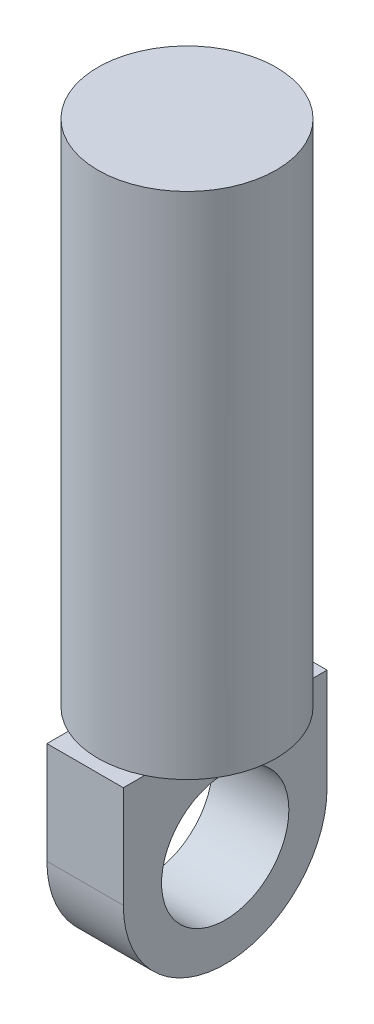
ISO-10303-21;
HEADER;
FILE_DESCRIPTION(('STEP AP214'),'2;1');
FILE_NAME('part.step','',(''),(''),'','','');
FILE_SCHEMA(('AUTOMOTIVE_DESIGN { 1 0 10303 214 1 1 1 1 }'));
ENDSEC;
DATA;
#1=APPLICATION_CONTEXT('core data for automotive mechanical design processes');
#2=APPLICATION_PROTOCOL_DEFINITION('international standard','automotive_design',2000,#1);
#3=PRODUCT_CONTEXT('',#1,'mechanical');
#4=PRODUCT('Part','Part','',(#3));
#5=PRODUCT_RELATED_PRODUCT_CATEGORY('part','',(#4));
#6=PRODUCT_DEFINITION_FORMATION('','',#4);
#7=PRODUCT_DEFINITION_CONTEXT('part definition',#1,'design');
#8=PRODUCT_DEFINITION('design','',#6,#7);
#9=PRODUCT_DEFINITION_SHAPE('','',#8);
#10=(LENGTH_UNIT() NAMED_UNIT(*) SI_UNIT(.MILLI.,.METRE.));
#11=(NAMED_UNIT(*) PLANE_ANGLE_UNIT() SI_UNIT($,.RADIAN.));
#12=(NAMED_UNIT(*) SI_UNIT($,.STERADIAN.) SOLID_ANGLE_UNIT());
#13=UNCERTAINTY_MEASURE_WITH_UNIT(LENGTH_MEASURE(1.E-05),#10,'distance_accuracy_value','');
#14=(GEOMETRIC_REPRESENTATION_CONTEXT(3) GLOBAL_UNCERTAINTY_ASSIGNED_CONTEXT((#13)) GLOBAL_UNIT_ASSIGNED_CONTEXT((#10,
#11,#12)) REPRESENTATION_CONTEXT('',''));
#15=CARTESIAN_POINT('',(0.,0.,0.));
#16=DIRECTION('',(0.,0.,1.));
#17=DIRECTION('',(1.,0.,0.));
#18=AXIS2_PLACEMENT_3D('',#15,#16,#17);
#19=CARTESIAN_POINT('',(37.5,100.,100.));
#20=DIRECTION('',(0.,-1.,0.));
#21=DIRECTION('',(0.,0.,-1.));
#22=AXIS2_PLACEMENT_3D('',#19,#20,#21);
#23=PLANE('',#22);
#24=CARTESIAN_POINT('',(0.,100.,0.));
#25=DIRECTION('',(0.,1.,0.));
#26=DIRECTION('',(0.,0.,1.));
#27=AXIS2_PLACEMENT_3D('',#24,#25,#26);
#28=CIRCLE('',#27,87.5);
#29=CARTESIAN_POINT('',(37.5,100.,-79.0569415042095));
#30=VERTEX_POINT('',#29);
#31=CARTESIAN_POINT('',(-37.5,100.,-79.0569415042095));
#32=VERTEX_POINT('',#31);
#33=EDGE_CURVE('E11',#30,#32,#28,.T.);
#34=ORIENTED_EDGE('',*,*,#33,.F.);
#35=DIRECTION('',(0.,0.,1.));
#36=VECTOR('',#35,1.);
#37=CARTESIAN_POINT('',(37.5,100.,100.));
#38=LINE('',#37,#36);
#39=CARTESIAN_POINT('',(37.5,100.,-100.));
#40=VERTEX_POINT('',#39);
#41=EDGE_CURVE('E98',#40,#30,#38,.T.);
#42=ORIENTED_EDGE('',*,*,#41,.F.);
#43=DIRECTION('',(-1.,0.,0.));
#44=VECTOR('',#43,1.);
#45=CARTESIAN_POINT('',(37.5,100.,-100.));
#46=LINE('',#45,#44);
#47=CARTESIAN_POINT('',(-37.5,100.,-100.));
#48=VERTEX_POINT('',#47);
#49=EDGE_CURVE('E143',#40,#48,#46,.T.);
#50=ORIENTED_EDGE('',*,*,#49,.T.);
#51=DIRECTION('',(0.,0.,1.));
#52=VECTOR('',#51,1.);
#53=CARTESIAN_POINT('',(-37.5,100.,100.));
#54=LINE('',#53,#52);
#55=EDGE_CURVE('E137',#48,#32,#54,.T.);
#56=ORIENTED_EDGE('',*,*,#55,.T.);
#57=EDGE_LOOP('',(#34,#42,#50,#56));
#58=FACE_BOUND('',#57,.T.);
#59=ADVANCED_FACE('F37',(#58),#23,.F.);
#60=CARTESIAN_POINT('',(37.5,0.,0.));
#61=DIRECTION('',(1.,0.,0.));
#62=DIRECTION('',(0.,0.,-1.));
#63=AXIS2_PLACEMENT_3D('',#60,#61,#62);
#64=PLANE('',#63);
#65=CARTESIAN_POINT('',(37.5,0.,0.));
#66=DIRECTION('',(1.,0.,0.));
#67=DIRECTION('',(0.,0.,-1.));
#68=AXIS2_PLACEMENT_3D('',#65,#66,#67);
#69=CIRCLE('',#68,100.);
#70=CARTESIAN_POINT('',(37.5,0.,100.));
#71=VERTEX_POINT('',#70);
#72=CARTESIAN_POINT('',(37.5,0.,-100.));
#73=VERTEX_POINT('',#72);
#74=EDGE_CURVE('E125',#71,#73,#69,.T.);
#75=ORIENTED_EDGE('',*,*,#74,.T.);
#76=DIRECTION('',(0.,1.,0.));
#77=VECTOR('',#76,1.);
#78=CARTESIAN_POINT('',(37.5,100.,-100.));
#79=LINE('',#78,#77);
#80=EDGE_CURVE('E107',#73,#40,#79,.T.);
#81=ORIENTED_EDGE('',*,*,#80,.T.);
#82=ORIENTED_EDGE('',*,*,#41,.T.);
#83=CARTESIAN_POINT('',(37.5,100.,79.0569415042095));
#84=VERTEX_POINT('',#83);
#85=EDGE_CURVE('E92',#30,#84,#38,.T.);
#86=ORIENTED_EDGE('',*,*,#85,.T.);
#87=CARTESIAN_POINT('',(37.5,100.,100.));
#88=VERTEX_POINT('',#87);
#89=EDGE_CURVE('E96',#84,#88,#38,.T.);
#90=ORIENTED_EDGE('',*,*,#89,.T.);
#91=DIRECTION('',(0.,-1.,0.));
#92=VECTOR('',#91,1.);
#93=CARTESIAN_POINT('',(37.5,0.,100.));
#94=LINE('',#93,#92);
#95=EDGE_CURVE('E129',#88,#71,#94,.T.);
#96=ORIENTED_EDGE('',*,*,#95,.T.);
#97=EDGE_LOOP('',(#75,#81,#82,#86,#90,#96));
#98=FACE_BOUND('',#97,.T.);
#99=CARTESIAN_POINT('',(37.5,0.,0.));
#100=DIRECTION('',(1.,0.,0.));
#101=DIRECTION('',(0.,0.,-1.));
#102=AXIS2_PLACEMENT_3D('',#99,#100,#101);
#103=CIRCLE('',#102,62.5);
#104=CARTESIAN_POINT('',(37.5,0.,-62.5));
#105=VERTEX_POINT('',#104);
#106=EDGE_CURVE('E119',#105,#105,#103,.T.);
#107=ORIENTED_EDGE('',*,*,#106,.F.);
#108=EDGE_LOOP('',(#107));
#109=FACE_BOUND('',#108,.T.);
#110=ADVANCED_FACE('F94',(#98,#109),#64,.T.);
#111=CARTESIAN_POINT('',(-37.5,0.,0.));
#112=DIRECTION('',(1.,0.,0.));
#113=DIRECTION('',(0.,0.,-1.));
#114=AXIS2_PLACEMENT_3D('',#111,#112,#113);
#115=PLANE('',#114);
#116=CARTESIAN_POINT('',(-37.5,0.,0.));
#117=DIRECTION('',(1.,0.,0.));
#118=DIRECTION('',(0.,0.,-1.));
#119=AXIS2_PLACEMENT_3D('',#116,#117,#118);
#120=CIRCLE('',#119,100.);
#121=CARTESIAN_POINT('',(-37.5,0.,100.));
#122=VERTEX_POINT('',#121);
#123=CARTESIAN_POINT('',(-37.5,0.,-100.));
#124=VERTEX_POINT('',#123);
#125=EDGE_CURVE('E122',#122,#124,#120,.T.);
#126=ORIENTED_EDGE('',*,*,#125,.F.);
#127=DIRECTION('',(0.,-1.,0.));
#128=VECTOR('',#127,1.);
#129=CARTESIAN_POINT('',(-37.5,0.,100.));
#130=LINE('',#129,#128);
#131=CARTESIAN_POINT('',(-37.5,100.,100.));
#132=VERTEX_POINT('',#131);
#133=EDGE_CURVE('E127',#132,#122,#130,.T.);
#134=ORIENTED_EDGE('',*,*,#133,.F.);
#135=CARTESIAN_POINT('',(-37.5,100.,79.0569415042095));
#136=VERTEX_POINT('',#135);
#137=EDGE_CURVE('E136',#136,#132,#54,.T.);
#138=ORIENTED_EDGE('',*,*,#137,.F.);
#139=EDGE_CURVE('E139',#32,#136,#54,.T.);
#140=ORIENTED_EDGE('',*,*,#139,.F.);
#141=ORIENTED_EDGE('',*,*,#55,.F.);
#142=DIRECTION('',(0.,1.,0.));
#143=VECTOR('',#142,1.);
#144=CARTESIAN_POINT('',(-37.5,100.,-100.));
#145=LINE('',#144,#143);
#146=EDGE_CURVE('E134',#124,#48,#145,.T.);
#147=ORIENTED_EDGE('',*,*,#146,.F.);
#148=EDGE_LOOP('',(#126,#134,#138,#140,#141,#147));
#149=FACE_BOUND('',#148,.T.);
#150=CARTESIAN_POINT('',(-37.5,0.,0.));
#151=DIRECTION('',(1.,0.,0.));
#152=DIRECTION('',(0.,0.,-1.));
#153=AXIS2_PLACEMENT_3D('',#150,#151,#152);
#154=CIRCLE('',#153,62.5);
#155=CARTESIAN_POINT('',(-37.5,0.,-62.5));
#156=VERTEX_POINT('',#155);
#157=EDGE_CURVE('E116',#156,#156,#154,.T.);
#158=ORIENTED_EDGE('',*,*,#157,.T.);
#159=EDGE_LOOP('',(#158));
#160=FACE_BOUND('',#159,.T.);
#161=ADVANCED_FACE('F157',(#149,#160),#115,.F.);
#162=CARTESIAN_POINT('',(37.5,0.,0.));
#163=DIRECTION('',(-1.,0.,0.));
#164=DIRECTION('',(0.,0.,1.));
#165=AXIS2_PLACEMENT_3D('',#162,#163,#164);
#166=CYLINDRICAL_SURFACE('',#165,100.);
#167=ORIENTED_EDGE('',*,*,#125,.T.);
#168=DIRECTION('',(-1.,0.,0.));
#169=VECTOR('',#168,1.);
#170=CARTESIAN_POINT('',(37.5,0.,-100.));
#171=LINE('',#170,#169);
#172=EDGE_CURVE('E41',#73,#124,#171,.T.);
#173=ORIENTED_EDGE('',*,*,#172,.F.);
#174=ORIENTED_EDGE('',*,*,#74,.F.);
#175=DIRECTION('',(-1.,0.,0.));
#176=VECTOR('',#175,1.);
#177=CARTESIAN_POINT('',(37.5,0.,100.));
#178=LINE('',#177,#176);
#179=EDGE_CURVE('E131',#71,#122,#178,.T.);
#180=ORIENTED_EDGE('',*,*,#179,.T.);
#181=EDGE_LOOP('',(#167,#173,#174,#180));
#182=FACE_BOUND('',#181,.T.);
#183=ADVANCED_FACE('F39',(#182),#166,.T.);
#184=CARTESIAN_POINT('',(37.5,100.,-100.));
#185=DIRECTION('',(0.,0.,1.));
#186=DIRECTION('',(1.,0.,0.));
#187=AXIS2_PLACEMENT_3D('',#184,#185,#186);
#188=PLANE('',#187);
#189=ORIENTED_EDGE('',*,*,#146,.T.);
#190=ORIENTED_EDGE('',*,*,#49,.F.);
#191=ORIENTED_EDGE('',*,*,#80,.F.);
#192=ORIENTED_EDGE('',*,*,#172,.T.);
#193=EDGE_LOOP('',(#189,#190,#191,#192));
#194=FACE_BOUND('',#193,.T.);
#195=ADVANCED_FACE('F150',(#194),#188,.F.);
#196=EDGE_CURVE('E46',#136,#84,#28,.T.);
#197=ORIENTED_EDGE('',*,*,#196,.F.);
#198=ORIENTED_EDGE('',*,*,#137,.T.);
#199=DIRECTION('',(-1.,0.,0.));
#200=VECTOR('',#199,1.);
#201=CARTESIAN_POINT('',(37.5,100.,100.));
#202=LINE('',#201,#200);
#203=EDGE_CURVE('E105',#88,#132,#202,.T.);
#204=ORIENTED_EDGE('',*,*,#203,.F.);
#205=ORIENTED_EDGE('',*,*,#89,.F.);
#206=EDGE_LOOP('',(#197,#198,#204,#205));
#207=FACE_BOUND('',#206,.T.);
#208=ADVANCED_FACE('F103',(#207),#23,.F.);
#209=CARTESIAN_POINT('',(37.5,0.,100.));
#210=DIRECTION('',(0.,0.,-1.));
#211=DIRECTION('',(-1.,0.,0.));
#212=AXIS2_PLACEMENT_3D('',#209,#210,#211);
#213=PLANE('',#212);
#214=ORIENTED_EDGE('',*,*,#133,.T.);
#215=ORIENTED_EDGE('',*,*,#179,.F.);
#216=ORIENTED_EDGE('',*,*,#95,.F.);
#217=ORIENTED_EDGE('',*,*,#203,.T.);
#218=EDGE_LOOP('',(#214,#215,#216,#217));
#219=FACE_BOUND('',#218,.T.);
#220=ADVANCED_FACE('F163',(#219),#213,.F.);
#221=CARTESIAN_POINT('',(37.5,0.,0.));
#222=DIRECTION('',(-1.,0.,0.));
#223=DIRECTION('',(0.,0.,1.));
#224=AXIS2_PLACEMENT_3D('',#221,#222,#223);
#225=CYLINDRICAL_SURFACE('',#224,62.5);
#226=ORIENTED_EDGE('',*,*,#106,.T.);
#227=EDGE_LOOP('',(#226));
#228=FACE_BOUND('',#227,.T.);
#229=ORIENTED_EDGE('',*,*,#157,.F.);
#230=EDGE_LOOP('',(#229));
#231=FACE_BOUND('',#230,.T.);
#232=ADVANCED_FACE('F165',(#228,#231),#225,.F.);
#233=CARTESIAN_POINT('',(0.,100.,0.));
#234=DIRECTION('',(0.,1.,0.));
#235=DIRECTION('',(0.,0.,1.));
#236=AXIS2_PLACEMENT_3D('',#233,#234,#235);
#237=PLANE('',#236);
#238=EDGE_CURVE('E48',#32,#136,#28,.T.);
#239=ORIENTED_EDGE('',*,*,#238,.F.);
#240=ORIENTED_EDGE('',*,*,#139,.T.);
#241=EDGE_LOOP('',(#239,#240));
#242=FACE_BOUND('',#241,.T.);
#243=ADVANCED_FACE('F161',(#242),#237,.F.);
#244=CARTESIAN_POINT('',(0.,600.,0.));
#245=DIRECTION('',(0.,-1.,0.));
#246=DIRECTION('',(0.,0.,-1.));
#247=AXIS2_PLACEMENT_3D('',#244,#245,#246);
#248=CYLINDRICAL_SURFACE('',#247,87.5);
#249=CARTESIAN_POINT('',(0.,600.,0.));
#250=DIRECTION('',(0.,1.,0.));
#251=DIRECTION('',(0.,0.,1.));
#252=AXIS2_PLACEMENT_3D('',#249,#250,#251);
#253=CIRCLE('',#252,87.5);
#254=CARTESIAN_POINT('',(0.,600.,87.5));
#255=VERTEX_POINT('',#254);
#256=EDGE_CURVE('E114',#255,#255,#253,.T.);
#257=ORIENTED_EDGE('',*,*,#256,.F.);
#258=EDGE_LOOP('',(#257));
#259=FACE_BOUND('',#258,.T.);
#260=EDGE_CURVE('E111',#84,#30,#28,.T.);
#261=ORIENTED_EDGE('',*,*,#260,.T.);
#262=ORIENTED_EDGE('',*,*,#33,.T.);
#263=ORIENTED_EDGE('',*,*,#238,.T.);
#264=ORIENTED_EDGE('',*,*,#196,.T.);
#265=EDGE_LOOP('',(#261,#262,#263,#264));
#266=FACE_BOUND('',#265,.T.);
#267=ADVANCED_FACE('F110',(#259,#266),#248,.T.);
#268=CARTESIAN_POINT('',(0.,600.,0.));
#269=DIRECTION('',(0.,1.,0.));
#270=DIRECTION('',(0.,0.,1.));
#271=AXIS2_PLACEMENT_3D('',#268,#269,#270);
#272=PLANE('',#271);
#273=ORIENTED_EDGE('',*,*,#256,.T.);
#274=EDGE_LOOP('',(#273));
#275=FACE_BOUND('',#274,.T.);
#276=ADVANCED_FACE('F192',(#275),#272,.T.);
#277=ORIENTED_EDGE('',*,*,#85,.F.);
#278=ORIENTED_EDGE('',*,*,#260,.F.);
#279=EDGE_LOOP('',(#277,#278));
#280=FACE_BOUND('',#279,.T.);
#281=ADVANCED_FACE('F113',(#280),#237,.F.);
#282=CLOSED_SHELL('',(#59,#110,#161,#183,#195,#208,#220,#232,#243,#267,#276,#281));
#283=MANIFOLD_SOLID_BREP('B2',#282);
#284=ADVANCED_BREP_SHAPE_REPRESENTATION('',(#18,#283),#14);
#285=SHAPE_DEFINITION_REPRESENTATION(#9,#284);
ENDSEC;
END-ISO-10303-21;
